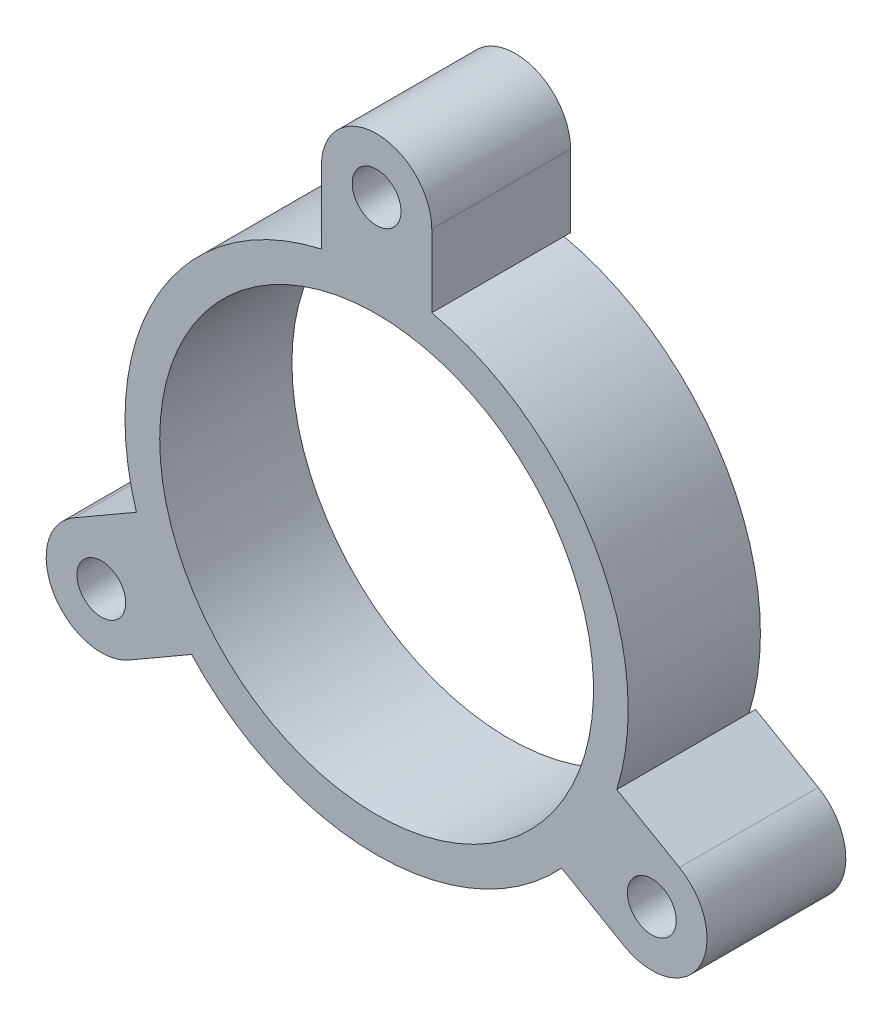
ISO-10303-21;
HEADER;
FILE_DESCRIPTION(('STEP AP214'),'2;1');
FILE_NAME('part.step','',(''),(''),'','','');
FILE_SCHEMA(('AUTOMOTIVE_DESIGN { 1 0 10303 214 1 1 1 1 }'));
ENDSEC;
DATA;
#1=APPLICATION_CONTEXT('core data for automotive mechanical design processes');
#2=APPLICATION_PROTOCOL_DEFINITION('international standard','automotive_design',2000,#1);
#3=PRODUCT_CONTEXT('',#1,'mechanical');
#4=PRODUCT('Part','Part','',(#3));
#5=PRODUCT_RELATED_PRODUCT_CATEGORY('part','',(#4));
#6=PRODUCT_DEFINITION_FORMATION('','',#4);
#7=PRODUCT_DEFINITION_CONTEXT('part definition',#1,'design');
#8=PRODUCT_DEFINITION('design','',#6,#7);
#9=PRODUCT_DEFINITION_SHAPE('','',#8);
#10=(LENGTH_UNIT() NAMED_UNIT(*) SI_UNIT(.MILLI.,.METRE.));
#11=(NAMED_UNIT(*) PLANE_ANGLE_UNIT() SI_UNIT($,.RADIAN.));
#12=(NAMED_UNIT(*) SI_UNIT($,.STERADIAN.) SOLID_ANGLE_UNIT());
#13=UNCERTAINTY_MEASURE_WITH_UNIT(LENGTH_MEASURE(1.E-05),#10,'distance_accuracy_value','');
#14=(GEOMETRIC_REPRESENTATION_CONTEXT(3) GLOBAL_UNCERTAINTY_ASSIGNED_CONTEXT((#13)) GLOBAL_UNIT_ASSIGNED_CONTEXT((#10,
#11,#12)) REPRESENTATION_CONTEXT('',''));
#15=CARTESIAN_POINT('',(0.,0.,0.));
#16=DIRECTION('',(0.,0.,1.));
#17=DIRECTION('',(1.,0.,0.));
#18=AXIS2_PLACEMENT_3D('',#15,#16,#17);
#19=CARTESIAN_POINT('',(0.,0.,7.62));
#20=DIRECTION('',(0.,0.,-1.));
#21=DIRECTION('',(-1.,0.,0.));
#22=AXIS2_PLACEMENT_3D('',#19,#20,#21);
#23=CYLINDRICAL_SURFACE('',#22,14.5);
#24=CARTESIAN_POINT('',(0.,0.,7.62));
#25=DIRECTION('',(0.,0.,1.));
#26=DIRECTION('',(1.,0.,0.));
#27=AXIS2_PLACEMENT_3D('',#24,#25,#26);
#28=CIRCLE('',#27,14.5);
#29=CARTESIAN_POINT('',(-10.6616611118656,-9.82746062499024,7.62));
#30=VERTEX_POINT('',#29);
#31=CARTESIAN_POINT('',(10.6616611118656,-9.82746062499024,7.62));
#32=VERTEX_POINT('',#31);
#33=EDGE_CURVE('E162',#30,#32,#28,.T.);
#34=ORIENTED_EDGE('',*,*,#33,.F.);
#35=DIRECTION('',(0.,0.,-1.));
#36=VECTOR('',#35,1.);
#37=CARTESIAN_POINT('',(-10.6616611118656,-9.82746062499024,7.62));
#38=LINE('',#37,#36);
#39=CARTESIAN_POINT('',(-10.6616611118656,-9.82746062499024,0.));
#40=VERTEX_POINT('',#39);
#41=EDGE_CURVE('E11',#30,#40,#38,.T.);
#42=ORIENTED_EDGE('',*,*,#41,.T.);
#43=CARTESIAN_POINT('',(0.,0.,0.));
#44=DIRECTION('',(0.,0.,1.));
#45=DIRECTION('',(1.,0.,0.));
#46=AXIS2_PLACEMENT_3D('',#43,#44,#45);
#47=CIRCLE('',#46,14.5);
#48=CARTESIAN_POINT('',(10.6616611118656,-9.82746062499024,0.));
#49=VERTEX_POINT('',#48);
#50=EDGE_CURVE('E173',#40,#49,#47,.T.);
#51=ORIENTED_EDGE('',*,*,#50,.T.);
#52=DIRECTION('',(0.,0.,-1.));
#53=VECTOR('',#52,1.);
#54=CARTESIAN_POINT('',(10.6616611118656,-9.82746062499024,7.62));
#55=LINE('',#54,#53);
#56=EDGE_CURVE('E394',#49,#32,#55,.F.);
#57=ORIENTED_EDGE('',*,*,#56,.T.);
#58=EDGE_LOOP('',(#34,#42,#51,#57));
#59=FACE_BOUND('',#58,.T.);
#60=ADVANCED_FACE('F29',(#59),#23,.T.);
#61=CARTESIAN_POINT('',(13.8416611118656,-4.31953905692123,7.62));
#62=VERTEX_POINT('',#61);
#63=CARTESIAN_POINT('',(3.18,14.1469996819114,7.62));
#64=VERTEX_POINT('',#63);
#65=EDGE_CURVE('E164',#62,#64,#28,.T.);
#66=ORIENTED_EDGE('',*,*,#65,.F.);
#67=DIRECTION('',(0.,0.,-1.));
#68=VECTOR('',#67,1.);
#69=CARTESIAN_POINT('',(13.8416611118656,-4.31953905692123,7.62));
#70=LINE('',#69,#68);
#71=CARTESIAN_POINT('',(13.8416611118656,-4.31953905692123,0.));
#72=VERTEX_POINT('',#71);
#73=EDGE_CURVE('E154',#62,#72,#70,.T.);
#74=ORIENTED_EDGE('',*,*,#73,.T.);
#75=CARTESIAN_POINT('',(3.18,14.1469996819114,0.));
#76=VERTEX_POINT('',#75);
#77=EDGE_CURVE('E185',#72,#76,#47,.T.);
#78=ORIENTED_EDGE('',*,*,#77,.T.);
#79=DIRECTION('',(0.,0.,-1.));
#80=VECTOR('',#79,1.);
#81=CARTESIAN_POINT('',(3.18,14.1469996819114,7.62));
#82=LINE('',#81,#80);
#83=EDGE_CURVE('E161',#76,#64,#82,.F.);
#84=ORIENTED_EDGE('',*,*,#83,.T.);
#85=EDGE_LOOP('',(#66,#74,#78,#84));
#86=FACE_BOUND('',#85,.T.);
#87=ADVANCED_FACE('F296',(#86),#23,.T.);
#88=CARTESIAN_POINT('',(0.,0.,7.62));
#89=DIRECTION('',(0.,0.,1.));
#90=DIRECTION('',(1.,0.,0.));
#91=AXIS2_PLACEMENT_3D('',#88,#89,#90);
#92=PLANE('',#91);
#93=CARTESIAN_POINT('',(-3.18,14.1469996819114,7.62));
#94=VERTEX_POINT('',#93);
#95=CARTESIAN_POINT('',(-13.8416611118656,-4.31953905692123,7.62));
#96=VERTEX_POINT('',#95);
#97=EDGE_CURVE('E151',#94,#96,#28,.T.);
#98=ORIENTED_EDGE('',*,*,#97,.T.);
#99=DIRECTION('',(-0.866025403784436,-0.500000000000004,0.));
#100=VECTOR('',#99,1.);
#101=CARTESIAN_POINT('',(-13.8416611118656,-4.31953905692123,7.62));
#102=LINE('',#101,#100);
#103=CARTESIAN_POINT('',(-17.4529870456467,-6.40453905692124,7.62));
#104=VERTEX_POINT('',#103);
#105=EDGE_CURVE('E136',#96,#104,#102,.T.);
#106=ORIENTED_EDGE('',*,*,#105,.T.);
#107=CARTESIAN_POINT('',(-15.8629870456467,-9.15849984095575,7.62));
#108=DIRECTION('',(0.,0.,1.));
#109=DIRECTION('',(-1.,0.,0.));
#110=AXIS2_PLACEMENT_3D('',#107,#108,#109);
#111=CIRCLE('',#110,3.18);
#112=CARTESIAN_POINT('',(-14.2729870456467,-11.9124606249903,7.62));
#113=VERTEX_POINT('',#112);
#114=EDGE_CURVE('E144',#104,#113,#111,.T.);
#115=ORIENTED_EDGE('',*,*,#114,.T.);
#116=DIRECTION('',(0.866025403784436,0.500000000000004,0.));
#117=VECTOR('',#116,1.);
#118=CARTESIAN_POINT('',(-10.6616611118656,-9.82746062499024,7.62));
#119=LINE('',#118,#117);
#120=EDGE_CURVE('E44',#113,#30,#119,.T.);
#121=ORIENTED_EDGE('',*,*,#120,.T.);
#122=ORIENTED_EDGE('',*,*,#33,.T.);
#123=DIRECTION('',(0.866025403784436,-0.500000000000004,0.));
#124=VECTOR('',#123,1.);
#125=CARTESIAN_POINT('',(10.6616611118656,-9.82746062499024,7.62));
#126=LINE('',#125,#124);
#127=CARTESIAN_POINT('',(14.2729870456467,-11.9124606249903,7.62));
#128=VERTEX_POINT('',#127);
#129=EDGE_CURVE('E256',#32,#128,#126,.T.);
#130=ORIENTED_EDGE('',*,*,#129,.T.);
#131=CARTESIAN_POINT('',(15.8629870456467,-9.15849984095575,7.62));
#132=DIRECTION('',(0.,0.,1.));
#133=DIRECTION('',(1.,0.,0.));
#134=AXIS2_PLACEMENT_3D('',#131,#132,#133);
#135=CIRCLE('',#134,3.18);
#136=CARTESIAN_POINT('',(17.4529870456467,-6.40453905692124,7.62));
#137=VERTEX_POINT('',#136);
#138=EDGE_CURVE('E254',#128,#137,#135,.T.);
#139=ORIENTED_EDGE('',*,*,#138,.T.);
#140=DIRECTION('',(-0.866025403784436,0.500000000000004,0.));
#141=VECTOR('',#140,1.);
#142=CARTESIAN_POINT('',(13.8416611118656,-4.31953905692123,7.62));
#143=LINE('',#142,#141);
#144=EDGE_CURVE('E51',#137,#62,#143,.T.);
#145=ORIENTED_EDGE('',*,*,#144,.T.);
#146=ORIENTED_EDGE('',*,*,#65,.T.);
#147=DIRECTION('',(0.,1.,0.));
#148=VECTOR('',#147,1.);
#149=CARTESIAN_POINT('',(3.18,14.1469996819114,7.62));
#150=LINE('',#149,#148);
#151=CARTESIAN_POINT('',(3.18,18.3169996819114,7.62));
#152=VERTEX_POINT('',#151);
#153=EDGE_CURVE('E225',#64,#152,#150,.T.);
#154=ORIENTED_EDGE('',*,*,#153,.T.);
#155=CARTESIAN_POINT('',(0.,18.3169996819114,7.62));
#156=DIRECTION('',(0.,0.,1.));
#157=DIRECTION('',(-1.,0.,0.));
#158=AXIS2_PLACEMENT_3D('',#155,#156,#157);
#159=CIRCLE('',#158,3.18);
#160=CARTESIAN_POINT('',(-3.18,18.3169996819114,7.62));
#161=VERTEX_POINT('',#160);
#162=EDGE_CURVE('E223',#152,#161,#159,.T.);
#163=ORIENTED_EDGE('',*,*,#162,.T.);
#164=DIRECTION('',(0.,-1.,0.));
#165=VECTOR('',#164,1.);
#166=CARTESIAN_POINT('',(-3.18,14.1469996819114,7.62));
#167=LINE('',#166,#165);
#168=EDGE_CURVE('E159',#161,#94,#167,.T.);
#169=ORIENTED_EDGE('',*,*,#168,.T.);
#170=EDGE_LOOP('',(#98,#106,#115,#121,#122,#130,#139,#145,#146,#154,#163,#169));
#171=FACE_BOUND('',#170,.T.);
#172=CARTESIAN_POINT('',(0.,0.,7.62));
#173=DIRECTION('',(0.,0.,1.));
#174=DIRECTION('',(1.,0.,0.));
#175=AXIS2_PLACEMENT_3D('',#172,#173,#174);
#176=CIRCLE('',#175,12.5);
#177=CARTESIAN_POINT('',(-12.5,0.,7.62));
#178=VERTEX_POINT('',#177);
#179=EDGE_CURVE('E190',#178,#178,#176,.T.);
#180=ORIENTED_EDGE('',*,*,#179,.F.);
#181=EDGE_LOOP('',(#180));
#182=FACE_BOUND('',#181,.T.);
#183=CARTESIAN_POINT('',(0.,18.3169996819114,7.62));
#184=DIRECTION('',(0.,0.,1.));
#185=DIRECTION('',(1.,0.,0.));
#186=AXIS2_PLACEMENT_3D('',#183,#184,#185);
#187=CIRCLE('',#186,1.405);
#188=CARTESIAN_POINT('',(1.405,18.3169996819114,7.62));
#189=VERTEX_POINT('',#188);
#190=EDGE_CURVE('E230',#189,#189,#187,.T.);
#191=ORIENTED_EDGE('',*,*,#190,.F.);
#192=EDGE_LOOP('',(#191));
#193=FACE_BOUND('',#192,.T.);
#194=CARTESIAN_POINT('',(15.8629870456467,-9.15849984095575,7.62));
#195=DIRECTION('',(0.,0.,1.));
#196=DIRECTION('',(-1.,0.,0.));
#197=AXIS2_PLACEMENT_3D('',#194,#195,#196);
#198=CIRCLE('',#197,1.405);
#199=CARTESIAN_POINT('',(14.4579870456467,-9.15849984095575,7.62));
#200=VERTEX_POINT('',#199);
#201=EDGE_CURVE('E262',#200,#200,#198,.T.);
#202=ORIENTED_EDGE('',*,*,#201,.F.);
#203=EDGE_LOOP('',(#202));
#204=FACE_BOUND('',#203,.T.);
#205=CARTESIAN_POINT('',(-15.8629870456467,-9.15849984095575,7.62));
#206=DIRECTION('',(0.,0.,1.));
#207=DIRECTION('',(1.,0.,0.));
#208=AXIS2_PLACEMENT_3D('',#205,#206,#207);
#209=CIRCLE('',#208,1.405);
#210=CARTESIAN_POINT('',(-14.4579870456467,-9.15849984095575,7.62));
#211=VERTEX_POINT('',#210);
#212=EDGE_CURVE('E288',#211,#211,#209,.T.);
#213=ORIENTED_EDGE('',*,*,#212,.F.);
#214=EDGE_LOOP('',(#213));
#215=FACE_BOUND('',#214,.T.);
#216=ADVANCED_FACE('F155',(#171,#182,#193,#204,#215),#92,.T.);
#217=CARTESIAN_POINT('',(0.,0.,0.));
#218=DIRECTION('',(0.,0.,1.));
#219=DIRECTION('',(1.,0.,0.));
#220=AXIS2_PLACEMENT_3D('',#217,#218,#219);
#221=PLANE('',#220);
#222=CARTESIAN_POINT('',(-3.18,14.1469996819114,0.));
#223=VERTEX_POINT('',#222);
#224=EDGE_CURVE('E169',#76,#223,#47,.T.);
#225=ORIENTED_EDGE('',*,*,#224,.F.);
#226=ORIENTED_EDGE('',*,*,#77,.F.);
#227=EDGE_CURVE('E179',#49,#72,#47,.T.);
#228=ORIENTED_EDGE('',*,*,#227,.F.);
#229=ORIENTED_EDGE('',*,*,#50,.F.);
#230=CARTESIAN_POINT('',(-13.8416611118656,-4.31953905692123,0.));
#231=VERTEX_POINT('',#230);
#232=EDGE_CURVE('E178',#231,#40,#47,.T.);
#233=ORIENTED_EDGE('',*,*,#232,.F.);
#234=EDGE_CURVE('E153',#223,#231,#47,.T.);
#235=ORIENTED_EDGE('',*,*,#234,.F.);
#236=EDGE_LOOP('',(#225,#226,#228,#229,#233,#235));
#237=FACE_BOUND('',#236,.T.);
#238=CARTESIAN_POINT('',(0.,0.,0.));
#239=DIRECTION('',(0.,0.,1.));
#240=DIRECTION('',(1.,0.,0.));
#241=AXIS2_PLACEMENT_3D('',#238,#239,#240);
#242=CIRCLE('',#241,12.5);
#243=CARTESIAN_POINT('',(-12.5,0.,0.));
#244=VERTEX_POINT('',#243);
#245=EDGE_CURVE('E196',#244,#244,#242,.T.);
#246=ORIENTED_EDGE('',*,*,#245,.T.);
#247=EDGE_LOOP('',(#246));
#248=FACE_BOUND('',#247,.T.);
#249=ADVANCED_FACE('F295',(#237,#248),#221,.F.);
#250=ORIENTED_EDGE('',*,*,#234,.T.);
#251=DIRECTION('',(0.,0.,-1.));
#252=VECTOR('',#251,1.);
#253=CARTESIAN_POINT('',(-13.8416611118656,-4.31953905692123,7.62));
#254=LINE('',#253,#252);
#255=EDGE_CURVE('E37',#231,#96,#254,.F.);
#256=ORIENTED_EDGE('',*,*,#255,.T.);
#257=ORIENTED_EDGE('',*,*,#97,.F.);
#258=DIRECTION('',(0.,0.,-1.));
#259=VECTOR('',#258,1.);
#260=CARTESIAN_POINT('',(-3.18,14.1469996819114,7.62));
#261=LINE('',#260,#259);
#262=EDGE_CURVE('E166',#94,#223,#261,.T.);
#263=ORIENTED_EDGE('',*,*,#262,.T.);
#264=EDGE_LOOP('',(#250,#256,#257,#263));
#265=FACE_BOUND('',#264,.T.);
#266=ADVANCED_FACE('F31',(#265),#23,.T.);
#267=CARTESIAN_POINT('',(0.,0.,7.62));
#268=DIRECTION('',(0.,0.,-1.));
#269=DIRECTION('',(-1.,0.,0.));
#270=AXIS2_PLACEMENT_3D('',#267,#268,#269);
#271=CYLINDRICAL_SURFACE('',#270,12.5);
#272=CARTESIAN_POINT('',(-12.5,0.,7.62));
#273=CARTESIAN_POINT('',(-12.5,0.,7.540625));
#274=CARTESIAN_POINT('',(-12.5,0.,7.46125));
#275=CARTESIAN_POINT('',(-12.5,0.,7.3025));
#276=CARTESIAN_POINT('',(-12.5,0.,7.223125));
#277=CARTESIAN_POINT('',(-12.5,0.,7.064375));
#278=CARTESIAN_POINT('',(-12.5,0.,6.985));
#279=CARTESIAN_POINT('',(-12.5,0.,6.82625));
#280=CARTESIAN_POINT('',(-12.5,0.,6.746875));
#281=CARTESIAN_POINT('',(-12.5,0.,6.588125));
#282=CARTESIAN_POINT('',(-12.5,0.,6.50875));
#283=CARTESIAN_POINT('',(-12.5,0.,6.35));
#284=CARTESIAN_POINT('',(-12.5,0.,6.270625));
#285=CARTESIAN_POINT('',(-12.5,0.,6.111875));
#286=CARTESIAN_POINT('',(-12.5,0.,6.0325));
#287=CARTESIAN_POINT('',(-12.5,0.,5.87375));
#288=CARTESIAN_POINT('',(-12.5,0.,5.794375));
#289=CARTESIAN_POINT('',(-12.5,0.,5.635625));
#290=CARTESIAN_POINT('',(-12.5,0.,5.55625));
#291=CARTESIAN_POINT('',(-12.5,0.,5.3975));
#292=CARTESIAN_POINT('',(-12.5,0.,5.318125));
#293=CARTESIAN_POINT('',(-12.5,0.,5.159375));
#294=CARTESIAN_POINT('',(-12.5,0.,5.08));
#295=CARTESIAN_POINT('',(-12.5,0.,4.92125));
#296=CARTESIAN_POINT('',(-12.5,0.,4.841875));
#297=CARTESIAN_POINT('',(-12.5,0.,4.683125));
#298=CARTESIAN_POINT('',(-12.5,0.,4.60375));
#299=CARTESIAN_POINT('',(-12.5,0.,4.445));
#300=CARTESIAN_POINT('',(-12.5,0.,4.365625));
#301=CARTESIAN_POINT('',(-12.5,0.,4.206875));
#302=CARTESIAN_POINT('',(-12.5,0.,4.1275));
#303=CARTESIAN_POINT('',(-12.5,0.,3.96875));
#304=CARTESIAN_POINT('',(-12.5,0.,3.889375));
#305=CARTESIAN_POINT('',(-12.5,0.,3.730625));
#306=CARTESIAN_POINT('',(-12.5,0.,3.65125));
#307=CARTESIAN_POINT('',(-12.5,0.,3.4925));
#308=CARTESIAN_POINT('',(-12.5,0.,3.413125));
#309=CARTESIAN_POINT('',(-12.5,0.,3.254375));
#310=CARTESIAN_POINT('',(-12.5,0.,3.175));
#311=CARTESIAN_POINT('',(-12.5,0.,3.01625));
#312=CARTESIAN_POINT('',(-12.5,0.,2.936875));
#313=CARTESIAN_POINT('',(-12.5,0.,2.778125));
#314=CARTESIAN_POINT('',(-12.5,0.,2.69875));
#315=CARTESIAN_POINT('',(-12.5,0.,2.54));
#316=CARTESIAN_POINT('',(-12.5,0.,2.460625));
#317=CARTESIAN_POINT('',(-12.5,0.,2.301875));
#318=CARTESIAN_POINT('',(-12.5,0.,2.2225));
#319=CARTESIAN_POINT('',(-12.5,0.,2.06375));
#320=CARTESIAN_POINT('',(-12.5,0.,1.984375));
#321=CARTESIAN_POINT('',(-12.5,0.,1.825625));
#322=CARTESIAN_POINT('',(-12.5,0.,1.74625));
#323=CARTESIAN_POINT('',(-12.5,0.,1.5875));
#324=CARTESIAN_POINT('',(-12.5,0.,1.508125));
#325=CARTESIAN_POINT('',(-12.5,0.,1.349375));
#326=CARTESIAN_POINT('',(-12.5,0.,1.27));
#327=CARTESIAN_POINT('',(-12.5,0.,1.11125));
#328=CARTESIAN_POINT('',(-12.5,0.,1.031875));
#329=CARTESIAN_POINT('',(-12.5,0.,0.873125));
#330=CARTESIAN_POINT('',(-12.5,0.,0.79375));
#331=CARTESIAN_POINT('',(-12.5,0.,0.635));
#332=CARTESIAN_POINT('',(-12.5,0.,0.555625));
#333=CARTESIAN_POINT('',(-12.5,0.,0.396875));
#334=CARTESIAN_POINT('',(-12.5,0.,0.3175));
#335=CARTESIAN_POINT('',(-12.5,0.,0.15875));
#336=CARTESIAN_POINT('',(-12.5,0.,0.0793749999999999));
#337=CARTESIAN_POINT('',(-12.5,0.,0.));
#338=B_SPLINE_CURVE_WITH_KNOTS('',3,(#272,#273,#274,#275,#276,#277,#278,#279,#280,#281,#282,
#283,#284,#285,#286,#287,#288,#289,#290,#291,#292,#293,#294,#295,#296,#297,#298,#299,#300,#301,
#302,#303,#304,#305,#306,#307,#308,#309,#310,#311,#312,#313,#314,#315,#316,#317,#318,#319,#320,
#321,#322,#323,#324,#325,#326,#327,#328,#329,#330,#331,#332,#333,#334,#335,#336,#337),
.UNSPECIFIED.,.F.,.F.,(4,2,2,2,2,2,2,2,2,2,2,2,2,2,2,2,2,2,2,2,2,2,2,2,2,2,2,2,2,2,2,2,4),(0.,
0.238125,0.476249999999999,0.714375,0.952499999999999,1.190625,1.42875,1.666875,1.905,2.143125,
2.38125,2.619375,2.8575,3.095625,3.33375,3.571875,3.81,4.048125,4.28625,4.524375,4.7625,
5.000625,5.23875,5.476875,5.715,5.953125,6.19125,6.429375,6.6675,6.905625,7.14375,7.381875,
7.62),.UNSPECIFIED.);
#339=EDGE_CURVE('BSEAM308',#178,#244,#338,.T.);
#340=ORIENTED_EDGE('',*,*,#179,.T.);
#341=ORIENTED_EDGE('',*,*,#245,.F.);
#342=ORIENTED_EDGE('',*,*,#339,.T.);
#343=ORIENTED_EDGE('',*,*,#339,.F.);
#344=EDGE_LOOP('',(#340,#342,#341,#343));
#345=FACE_BOUND('',#344,.T.);
#346=ADVANCED_FACE('F308',(#345),#271,.F.);
#347=CARTESIAN_POINT('',(0.,0.,-0.380000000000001));
#348=DIRECTION('',(0.,0.,1.));
#349=DIRECTION('',(1.,0.,0.));
#350=AXIS2_PLACEMENT_3D('',#347,#348,#349);
#351=CYLINDRICAL_SURFACE('',#350,14.5);
#352=ORIENTED_EDGE('',*,*,#224,.T.);
#353=DIRECTION('',(0.,0.,1.));
#354=VECTOR('',#353,1.);
#355=CARTESIAN_POINT('',(-3.18,14.1469996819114,-0.380000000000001));
#356=LINE('',#355,#354);
#357=CARTESIAN_POINT('',(-3.18,14.1469996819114,-0.380000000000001));
#358=VERTEX_POINT('',#357);
#359=EDGE_CURVE('E200',#358,#223,#356,.T.);
#360=ORIENTED_EDGE('',*,*,#359,.F.);
#361=CARTESIAN_POINT('',(0.,0.,-0.380000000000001));
#362=DIRECTION('',(0.,0.,-1.));
#363=DIRECTION('',(1.,0.,0.));
#364=AXIS2_PLACEMENT_3D('',#361,#362,#363);
#365=CIRCLE('',#364,14.5);
#366=CARTESIAN_POINT('',(3.18,14.1469996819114,-0.380000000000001));
#367=VERTEX_POINT('',#366);
#368=EDGE_CURVE('E219',#358,#367,#365,.T.);
#369=ORIENTED_EDGE('',*,*,#368,.T.);
#370=DIRECTION('',(0.,0.,1.));
#371=VECTOR('',#370,1.);
#372=CARTESIAN_POINT('',(3.18,14.1469996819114,-0.380000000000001));
#373=LINE('',#372,#371);
#374=EDGE_CURVE('E203',#367,#76,#373,.T.);
#375=ORIENTED_EDGE('',*,*,#374,.T.);
#376=EDGE_LOOP('',(#352,#360,#369,#375));
#377=FACE_BOUND('',#376,.T.);
#378=ADVANCED_FACE('F312',(#377),#351,.F.);
#379=CARTESIAN_POINT('',(-3.18,14.1469996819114,-0.380000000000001));
#380=DIRECTION('',(-1.,0.,0.));
#381=DIRECTION('',(0.,0.,1.));
#382=AXIS2_PLACEMENT_3D('',#379,#380,#381);
#383=PLANE('',#382);
#384=ORIENTED_EDGE('',*,*,#168,.F.);
#385=DIRECTION('',(0.,0.,1.));
#386=VECTOR('',#385,1.);
#387=CARTESIAN_POINT('',(-3.18,18.3169996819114,-0.380000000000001));
#388=LINE('',#387,#386);
#389=CARTESIAN_POINT('',(-3.18,18.3169996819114,-0.380000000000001));
#390=VERTEX_POINT('',#389);
#391=EDGE_CURVE('E208',#390,#161,#388,.T.);
#392=ORIENTED_EDGE('',*,*,#391,.F.);
#393=DIRECTION('',(0.,-1.,0.));
#394=VECTOR('',#393,1.);
#395=CARTESIAN_POINT('',(-3.18,14.1469996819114,-0.380000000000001));
#396=LINE('',#395,#394);
#397=EDGE_CURVE('E206',#390,#358,#396,.T.);
#398=ORIENTED_EDGE('',*,*,#397,.T.);
#399=ORIENTED_EDGE('',*,*,#359,.T.);
#400=ORIENTED_EDGE('',*,*,#262,.F.);
#401=EDGE_LOOP('',(#384,#392,#398,#399,#400));
#402=FACE_BOUND('',#401,.T.);
#403=ADVANCED_FACE('F317',(#402),#383,.T.);
#404=CARTESIAN_POINT('',(0.,18.3169996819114,-0.380000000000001));
#405=DIRECTION('',(0.,0.,1.));
#406=DIRECTION('',(1.,0.,0.));
#407=AXIS2_PLACEMENT_3D('',#404,#405,#406);
#408=CYLINDRICAL_SURFACE('',#407,3.18);
#409=ORIENTED_EDGE('',*,*,#162,.F.);
#410=DIRECTION('',(0.,0.,1.));
#411=VECTOR('',#410,1.);
#412=CARTESIAN_POINT('',(3.18,18.3169996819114,-0.380000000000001));
#413=LINE('',#412,#411);
#414=CARTESIAN_POINT('',(3.18,18.3169996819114,-0.380000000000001));
#415=VERTEX_POINT('',#414);
#416=EDGE_CURVE('E205',#415,#152,#413,.T.);
#417=ORIENTED_EDGE('',*,*,#416,.F.);
#418=CARTESIAN_POINT('',(0.,18.3169996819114,-0.380000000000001));
#419=DIRECTION('',(0.,0.,1.));
#420=DIRECTION('',(-1.,0.,0.));
#421=AXIS2_PLACEMENT_3D('',#418,#419,#420);
#422=CIRCLE('',#421,3.18);
#423=EDGE_CURVE('E213',#415,#390,#422,.T.);
#424=ORIENTED_EDGE('',*,*,#423,.T.);
#425=ORIENTED_EDGE('',*,*,#391,.T.);
#426=EDGE_LOOP('',(#409,#417,#424,#425));
#427=FACE_BOUND('',#426,.T.);
#428=ADVANCED_FACE('F325',(#427),#408,.T.);
#429=CARTESIAN_POINT('',(3.18,14.1469996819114,-0.380000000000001));
#430=DIRECTION('',(1.,0.,0.));
#431=DIRECTION('',(0.,0.,-1.));
#432=AXIS2_PLACEMENT_3D('',#429,#430,#431);
#433=PLANE('',#432);
#434=ORIENTED_EDGE('',*,*,#153,.F.);
#435=ORIENTED_EDGE('',*,*,#83,.F.);
#436=ORIENTED_EDGE('',*,*,#374,.F.);
#437=DIRECTION('',(0.,1.,0.));
#438=VECTOR('',#437,1.);
#439=CARTESIAN_POINT('',(3.18,14.1469996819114,-0.380000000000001));
#440=LINE('',#439,#438);
#441=EDGE_CURVE('E216',#367,#415,#440,.T.);
#442=ORIENTED_EDGE('',*,*,#441,.T.);
#443=ORIENTED_EDGE('',*,*,#416,.T.);
#444=EDGE_LOOP('',(#434,#435,#436,#442,#443));
#445=FACE_BOUND('',#444,.T.);
#446=ADVANCED_FACE('F321',(#445),#433,.T.);
#447=CARTESIAN_POINT('',(0.,0.,-0.380000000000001));
#448=DIRECTION('',(0.,0.,1.));
#449=DIRECTION('',(1.,0.,0.));
#450=AXIS2_PLACEMENT_3D('',#447,#448,#449);
#451=PLANE('',#450);
#452=CARTESIAN_POINT('',(0.,18.3169996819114,-0.380000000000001));
#453=DIRECTION('',(0.,0.,1.));
#454=DIRECTION('',(1.,0.,0.));
#455=AXIS2_PLACEMENT_3D('',#452,#453,#454);
#456=CIRCLE('',#455,1.405);
#457=CARTESIAN_POINT('',(1.405,18.3169996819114,-0.380000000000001));
#458=VERTEX_POINT('',#457);
#459=EDGE_CURVE('E227',#458,#458,#456,.T.);
#460=ORIENTED_EDGE('',*,*,#459,.T.);
#461=EDGE_LOOP('',(#460));
#462=FACE_BOUND('',#461,.T.);
#463=ORIENTED_EDGE('',*,*,#368,.F.);
#464=ORIENTED_EDGE('',*,*,#397,.F.);
#465=ORIENTED_EDGE('',*,*,#423,.F.);
#466=ORIENTED_EDGE('',*,*,#441,.F.);
#467=EDGE_LOOP('',(#463,#464,#465,#466));
#468=FACE_BOUND('',#467,.T.);
#469=ADVANCED_FACE('F324',(#462,#468),#451,.F.);
#470=CARTESIAN_POINT('',(0.,18.3169996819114,-0.380000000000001));
#471=DIRECTION('',(0.,0.,1.));
#472=DIRECTION('',(1.,0.,0.));
#473=AXIS2_PLACEMENT_3D('',#470,#471,#472);
#474=CYLINDRICAL_SURFACE('',#473,1.405);
#475=ORIENTED_EDGE('',*,*,#459,.F.);
#476=EDGE_LOOP('',(#475));
#477=FACE_BOUND('',#476,.T.);
#478=ORIENTED_EDGE('',*,*,#190,.T.);
#479=EDGE_LOOP('',(#478));
#480=FACE_BOUND('',#479,.T.);
#481=ADVANCED_FACE('F335',(#477,#480),#474,.F.);
#482=CARTESIAN_POINT('',(0.,0.,-0.380000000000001));
#483=DIRECTION('',(0.,0.,1.));
#484=DIRECTION('',(1.,0.,0.));
#485=AXIS2_PLACEMENT_3D('',#482,#483,#484);
#486=CYLINDRICAL_SURFACE('',#485,14.5);
#487=ORIENTED_EDGE('',*,*,#227,.T.);
#488=DIRECTION('',(0.,0.,1.));
#489=VECTOR('',#488,1.);
#490=CARTESIAN_POINT('',(13.8416611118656,-4.31953905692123,-0.380000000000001));
#491=LINE('',#490,#489);
#492=CARTESIAN_POINT('',(13.8416611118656,-4.31953905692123,-0.380000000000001));
#493=VERTEX_POINT('',#492);
#494=EDGE_CURVE('E233',#493,#72,#491,.T.);
#495=ORIENTED_EDGE('',*,*,#494,.F.);
#496=CARTESIAN_POINT('',(0.,0.,-0.380000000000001));
#497=DIRECTION('',(0.,0.,-1.));
#498=DIRECTION('',(-1.,0.,0.));
#499=AXIS2_PLACEMENT_3D('',#496,#497,#498);
#500=CIRCLE('',#499,14.5);
#501=CARTESIAN_POINT('',(10.6616611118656,-9.82746062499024,-0.380000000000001));
#502=VERTEX_POINT('',#501);
#503=EDGE_CURVE('E250',#493,#502,#500,.T.);
#504=ORIENTED_EDGE('',*,*,#503,.T.);
#505=DIRECTION('',(0.,0.,1.));
#506=VECTOR('',#505,1.);
#507=CARTESIAN_POINT('',(10.6616611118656,-9.82746062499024,-0.380000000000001));
#508=LINE('',#507,#506);
#509=EDGE_CURVE('E234',#502,#49,#508,.T.);
#510=ORIENTED_EDGE('',*,*,#509,.T.);
#511=EDGE_LOOP('',(#487,#495,#504,#510));
#512=FACE_BOUND('',#511,.T.);
#513=ADVANCED_FACE('F339',(#512),#486,.F.);
#514=CARTESIAN_POINT('',(13.8416611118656,-4.31953905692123,-0.380000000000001));
#515=DIRECTION('',(0.500000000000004,0.866025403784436,0.));
#516=DIRECTION('',(-0.866025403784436,0.500000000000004,0.));
#517=AXIS2_PLACEMENT_3D('',#514,#515,#516);
#518=PLANE('',#517);
#519=ORIENTED_EDGE('',*,*,#144,.F.);
#520=DIRECTION('',(0.,0.,1.));
#521=VECTOR('',#520,1.);
#522=CARTESIAN_POINT('',(17.4529870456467,-6.40453905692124,-0.380000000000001));
#523=LINE('',#522,#521);
#524=CARTESIAN_POINT('',(17.4529870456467,-6.40453905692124,-0.380000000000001));
#525=VERTEX_POINT('',#524);
#526=EDGE_CURVE('E239',#525,#137,#523,.T.);
#527=ORIENTED_EDGE('',*,*,#526,.F.);
#528=DIRECTION('',(-0.866025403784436,0.500000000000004,0.));
#529=VECTOR('',#528,1.);
#530=CARTESIAN_POINT('',(13.8416611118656,-4.31953905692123,-0.380000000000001));
#531=LINE('',#530,#529);
#532=EDGE_CURVE('E237',#525,#493,#531,.T.);
#533=ORIENTED_EDGE('',*,*,#532,.T.);
#534=ORIENTED_EDGE('',*,*,#494,.T.);
#535=ORIENTED_EDGE('',*,*,#73,.F.);
#536=EDGE_LOOP('',(#519,#527,#533,#534,#535));
#537=FACE_BOUND('',#536,.T.);
#538=ADVANCED_FACE('F343',(#537),#518,.T.);
#539=CARTESIAN_POINT('',(15.8629870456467,-9.15849984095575,-0.380000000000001));
#540=DIRECTION('',(0.,0.,1.));
#541=DIRECTION('',(1.,0.,0.));
#542=AXIS2_PLACEMENT_3D('',#539,#540,#541);
#543=CYLINDRICAL_SURFACE('',#542,3.18);
#544=ORIENTED_EDGE('',*,*,#138,.F.);
#545=DIRECTION('',(0.,0.,1.));
#546=VECTOR('',#545,1.);
#547=CARTESIAN_POINT('',(14.2729870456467,-11.9124606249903,-0.380000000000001));
#548=LINE('',#547,#546);
#549=CARTESIAN_POINT('',(14.2729870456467,-11.9124606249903,-0.380000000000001));
#550=VERTEX_POINT('',#549);
#551=EDGE_CURVE('E236',#550,#128,#548,.T.);
#552=ORIENTED_EDGE('',*,*,#551,.F.);
#553=CARTESIAN_POINT('',(15.8629870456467,-9.15849984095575,-0.380000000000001));
#554=DIRECTION('',(0.,0.,1.));
#555=DIRECTION('',(1.,0.,0.));
#556=AXIS2_PLACEMENT_3D('',#553,#554,#555);
#557=CIRCLE('',#556,3.18);
#558=EDGE_CURVE('E244',#550,#525,#557,.T.);
#559=ORIENTED_EDGE('',*,*,#558,.T.);
#560=ORIENTED_EDGE('',*,*,#526,.T.);
#561=EDGE_LOOP('',(#544,#552,#559,#560));
#562=FACE_BOUND('',#561,.T.);
#563=ADVANCED_FACE('F348',(#562),#543,.T.);
#564=CARTESIAN_POINT('',(10.6616611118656,-9.82746062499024,-0.380000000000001));
#565=DIRECTION('',(-0.500000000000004,-0.866025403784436,0.));
#566=DIRECTION('',(0.866025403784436,-0.500000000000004,0.));
#567=AXIS2_PLACEMENT_3D('',#564,#565,#566);
#568=PLANE('',#567);
#569=ORIENTED_EDGE('',*,*,#129,.F.);
#570=ORIENTED_EDGE('',*,*,#56,.F.);
#571=ORIENTED_EDGE('',*,*,#509,.F.);
#572=DIRECTION('',(0.866025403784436,-0.500000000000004,0.));
#573=VECTOR('',#572,1.);
#574=CARTESIAN_POINT('',(10.6616611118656,-9.82746062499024,-0.380000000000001));
#575=LINE('',#574,#573);
#576=EDGE_CURVE('E247',#502,#550,#575,.T.);
#577=ORIENTED_EDGE('',*,*,#576,.T.);
#578=ORIENTED_EDGE('',*,*,#551,.T.);
#579=EDGE_LOOP('',(#569,#570,#571,#577,#578));
#580=FACE_BOUND('',#579,.T.);
#581=ADVANCED_FACE('F344',(#580),#568,.T.);
#582=CARTESIAN_POINT('',(0.,0.,-0.380000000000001));
#583=DIRECTION('',(0.,0.,-1.));
#584=DIRECTION('',(-1.,0.,0.));
#585=AXIS2_PLACEMENT_3D('',#582,#583,#584);
#586=PLANE('',#585);
#587=CARTESIAN_POINT('',(15.8629870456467,-9.15849984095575,-0.380000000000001));
#588=DIRECTION('',(0.,0.,1.));
#589=DIRECTION('',(-1.,0.,0.));
#590=AXIS2_PLACEMENT_3D('',#587,#588,#589);
#591=CIRCLE('',#590,1.405);
#592=CARTESIAN_POINT('',(14.4579870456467,-9.15849984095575,-0.380000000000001));
#593=VERTEX_POINT('',#592);
#594=EDGE_CURVE('E259',#593,#593,#591,.T.);
#595=ORIENTED_EDGE('',*,*,#594,.T.);
#596=EDGE_LOOP('',(#595));
#597=FACE_BOUND('',#596,.T.);
#598=ORIENTED_EDGE('',*,*,#503,.F.);
#599=ORIENTED_EDGE('',*,*,#532,.F.);
#600=ORIENTED_EDGE('',*,*,#558,.F.);
#601=ORIENTED_EDGE('',*,*,#576,.F.);
#602=EDGE_LOOP('',(#598,#599,#600,#601));
#603=FACE_BOUND('',#602,.T.);
#604=ADVANCED_FACE('F347',(#597,#603),#586,.T.);
#605=CARTESIAN_POINT('',(15.8629870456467,-9.15849984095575,-0.380000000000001));
#606=DIRECTION('',(0.,0.,1.));
#607=DIRECTION('',(1.,0.,0.));
#608=AXIS2_PLACEMENT_3D('',#605,#606,#607);
#609=CYLINDRICAL_SURFACE('',#608,1.405);
#610=ORIENTED_EDGE('',*,*,#594,.F.);
#611=EDGE_LOOP('',(#610));
#612=FACE_BOUND('',#611,.T.);
#613=ORIENTED_EDGE('',*,*,#201,.T.);
#614=EDGE_LOOP('',(#613));
#615=FACE_BOUND('',#614,.T.);
#616=ADVANCED_FACE('F358',(#612,#615),#609,.F.);
#617=CARTESIAN_POINT('',(0.,0.,-0.380000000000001));
#618=DIRECTION('',(0.,0.,1.));
#619=DIRECTION('',(1.,0.,0.));
#620=AXIS2_PLACEMENT_3D('',#617,#618,#619);
#621=CYLINDRICAL_SURFACE('',#620,14.5);
#622=ORIENTED_EDGE('',*,*,#232,.T.);
#623=DIRECTION('',(0.,0.,1.));
#624=VECTOR('',#623,1.);
#625=CARTESIAN_POINT('',(-10.6616611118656,-9.82746062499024,-0.380000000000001));
#626=LINE('',#625,#624);
#627=CARTESIAN_POINT('',(-10.6616611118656,-9.82746062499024,-0.380000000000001));
#628=VERTEX_POINT('',#627);
#629=EDGE_CURVE('E265',#628,#40,#626,.T.);
#630=ORIENTED_EDGE('',*,*,#629,.F.);
#631=CARTESIAN_POINT('',(0.,0.,-0.380000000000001));
#632=DIRECTION('',(0.,0.,-1.));
#633=DIRECTION('',(1.,0.,0.));
#634=AXIS2_PLACEMENT_3D('',#631,#632,#633);
#635=CIRCLE('',#634,14.5);
#636=CARTESIAN_POINT('',(-13.8416611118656,-4.31953905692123,-0.380000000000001));
#637=VERTEX_POINT('',#636);
#638=EDGE_CURVE('E281',#628,#637,#635,.T.);
#639=ORIENTED_EDGE('',*,*,#638,.T.);
#640=DIRECTION('',(0.,0.,1.));
#641=VECTOR('',#640,1.);
#642=CARTESIAN_POINT('',(-13.8416611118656,-4.31953905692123,-0.380000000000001));
#643=LINE('',#642,#641);
#644=EDGE_CURVE('E266',#637,#231,#643,.T.);
#645=ORIENTED_EDGE('',*,*,#644,.T.);
#646=EDGE_LOOP('',(#622,#630,#639,#645));
#647=FACE_BOUND('',#646,.T.);
#648=ADVANCED_FACE('F362',(#647),#621,.F.);
#649=CARTESIAN_POINT('',(-10.6616611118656,-9.82746062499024,-0.380000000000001));
#650=DIRECTION('',(0.500000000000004,-0.866025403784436,0.));
#651=DIRECTION('',(0.866025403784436,0.500000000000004,0.));
#652=AXIS2_PLACEMENT_3D('',#649,#650,#651);
#653=PLANE('',#652);
#654=ORIENTED_EDGE('',*,*,#120,.F.);
#655=DIRECTION('',(0.,0.,1.));
#656=VECTOR('',#655,1.);
#657=CARTESIAN_POINT('',(-14.2729870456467,-11.9124606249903,-0.380000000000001));
#658=LINE('',#657,#656);
#659=CARTESIAN_POINT('',(-14.2729870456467,-11.9124606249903,-0.380000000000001));
#660=VERTEX_POINT('',#659);
#661=EDGE_CURVE('E270',#660,#113,#658,.T.);
#662=ORIENTED_EDGE('',*,*,#661,.F.);
#663=DIRECTION('',(0.866025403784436,0.500000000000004,0.));
#664=VECTOR('',#663,1.);
#665=CARTESIAN_POINT('',(-10.6616611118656,-9.82746062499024,-0.380000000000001));
#666=LINE('',#665,#664);
#667=EDGE_CURVE('E268',#660,#628,#666,.T.);
#668=ORIENTED_EDGE('',*,*,#667,.T.);
#669=ORIENTED_EDGE('',*,*,#629,.T.);
#670=ORIENTED_EDGE('',*,*,#41,.F.);
#671=EDGE_LOOP('',(#654,#662,#668,#669,#670));
#672=FACE_BOUND('',#671,.T.);
#673=ADVANCED_FACE('F366',(#672),#653,.T.);
#674=CARTESIAN_POINT('',(-15.8629870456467,-9.15849984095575,-0.380000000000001));
#675=DIRECTION('',(0.,0.,1.));
#676=DIRECTION('',(1.,0.,0.));
#677=AXIS2_PLACEMENT_3D('',#674,#675,#676);
#678=CYLINDRICAL_SURFACE('',#677,3.18);
#679=ORIENTED_EDGE('',*,*,#114,.F.);
#680=DIRECTION('',(0.,0.,1.));
#681=VECTOR('',#680,1.);
#682=CARTESIAN_POINT('',(-17.4529870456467,-6.40453905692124,-0.380000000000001));
#683=LINE('',#682,#681);
#684=CARTESIAN_POINT('',(-17.4529870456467,-6.40453905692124,-0.380000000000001));
#685=VERTEX_POINT('',#684);
#686=EDGE_CURVE('E141',#685,#104,#683,.T.);
#687=ORIENTED_EDGE('',*,*,#686,.F.);
#688=CARTESIAN_POINT('',(-15.8629870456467,-9.15849984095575,-0.380000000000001));
#689=DIRECTION('',(0.,0.,1.));
#690=DIRECTION('',(-1.,0.,0.));
#691=AXIS2_PLACEMENT_3D('',#688,#689,#690);
#692=CIRCLE('',#691,3.18);
#693=EDGE_CURVE('E276',#685,#660,#692,.T.);
#694=ORIENTED_EDGE('',*,*,#693,.T.);
#695=ORIENTED_EDGE('',*,*,#661,.T.);
#696=EDGE_LOOP('',(#679,#687,#694,#695));
#697=FACE_BOUND('',#696,.T.);
#698=ADVANCED_FACE('F371',(#697),#678,.T.);
#699=CARTESIAN_POINT('',(-13.8416611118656,-4.31953905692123,-0.380000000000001));
#700=DIRECTION('',(-0.500000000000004,0.866025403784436,0.));
#701=DIRECTION('',(-0.866025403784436,-0.500000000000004,0.));
#702=AXIS2_PLACEMENT_3D('',#699,#700,#701);
#703=PLANE('',#702);
#704=ORIENTED_EDGE('',*,*,#105,.F.);
#705=ORIENTED_EDGE('',*,*,#255,.F.);
#706=ORIENTED_EDGE('',*,*,#644,.F.);
#707=DIRECTION('',(-0.866025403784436,-0.500000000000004,0.));
#708=VECTOR('',#707,1.);
#709=CARTESIAN_POINT('',(-13.8416611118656,-4.31953905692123,-0.380000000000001));
#710=LINE('',#709,#708);
#711=EDGE_CURVE('E279',#637,#685,#710,.T.);
#712=ORIENTED_EDGE('',*,*,#711,.T.);
#713=ORIENTED_EDGE('',*,*,#686,.T.);
#714=EDGE_LOOP('',(#704,#705,#706,#712,#713));
#715=FACE_BOUND('',#714,.T.);
#716=ADVANCED_FACE('F138',(#715),#703,.T.);
#717=CARTESIAN_POINT('',(0.,0.,-0.380000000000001));
#718=DIRECTION('',(0.,0.,1.));
#719=DIRECTION('',(1.,0.,0.));
#720=AXIS2_PLACEMENT_3D('',#717,#718,#719);
#721=PLANE('',#720);
#722=CARTESIAN_POINT('',(-15.8629870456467,-9.15849984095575,-0.380000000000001));
#723=DIRECTION('',(0.,0.,1.));
#724=DIRECTION('',(1.,0.,0.));
#725=AXIS2_PLACEMENT_3D('',#722,#723,#724);
#726=CIRCLE('',#725,1.405);
#727=CARTESIAN_POINT('',(-14.4579870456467,-9.15849984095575,-0.380000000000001));
#728=VERTEX_POINT('',#727);
#729=EDGE_CURVE('E145',#728,#728,#726,.T.);
#730=ORIENTED_EDGE('',*,*,#729,.T.);
#731=EDGE_LOOP('',(#730));
#732=FACE_BOUND('',#731,.T.);
#733=ORIENTED_EDGE('',*,*,#638,.F.);
#734=ORIENTED_EDGE('',*,*,#667,.F.);
#735=ORIENTED_EDGE('',*,*,#693,.F.);
#736=ORIENTED_EDGE('',*,*,#711,.F.);
#737=EDGE_LOOP('',(#733,#734,#735,#736));
#738=FACE_BOUND('',#737,.T.);
#739=ADVANCED_FACE('F370',(#732,#738),#721,.F.);
#740=CARTESIAN_POINT('',(-15.8629870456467,-9.15849984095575,-0.380000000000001));
#741=DIRECTION('',(0.,0.,1.));
#742=DIRECTION('',(1.,0.,0.));
#743=AXIS2_PLACEMENT_3D('',#740,#741,#742);
#744=CYLINDRICAL_SURFACE('',#743,1.405);
#745=ORIENTED_EDGE('',*,*,#729,.F.);
#746=EDGE_LOOP('',(#745));
#747=FACE_BOUND('',#746,.T.);
#748=ORIENTED_EDGE('',*,*,#212,.T.);
#749=EDGE_LOOP('',(#748));
#750=FACE_BOUND('',#749,.T.);
#751=ADVANCED_FACE('F292',(#747,#750),#744,.F.);
#752=CLOSED_SHELL('',(#60,#87,#216,#249,#266,#346,#378,#403,#428,#446,#469,#481,#513,#538,#563,
#581,#604,#616,#648,#673,#698,#716,#739,#751));
#753=MANIFOLD_SOLID_BREP('B2',#752);
#754=ADVANCED_BREP_SHAPE_REPRESENTATION('',(#18,#753),#14);
#755=SHAPE_DEFINITION_REPRESENTATION(#9,#754);
ENDSEC;
END-ISO-10303-21;
